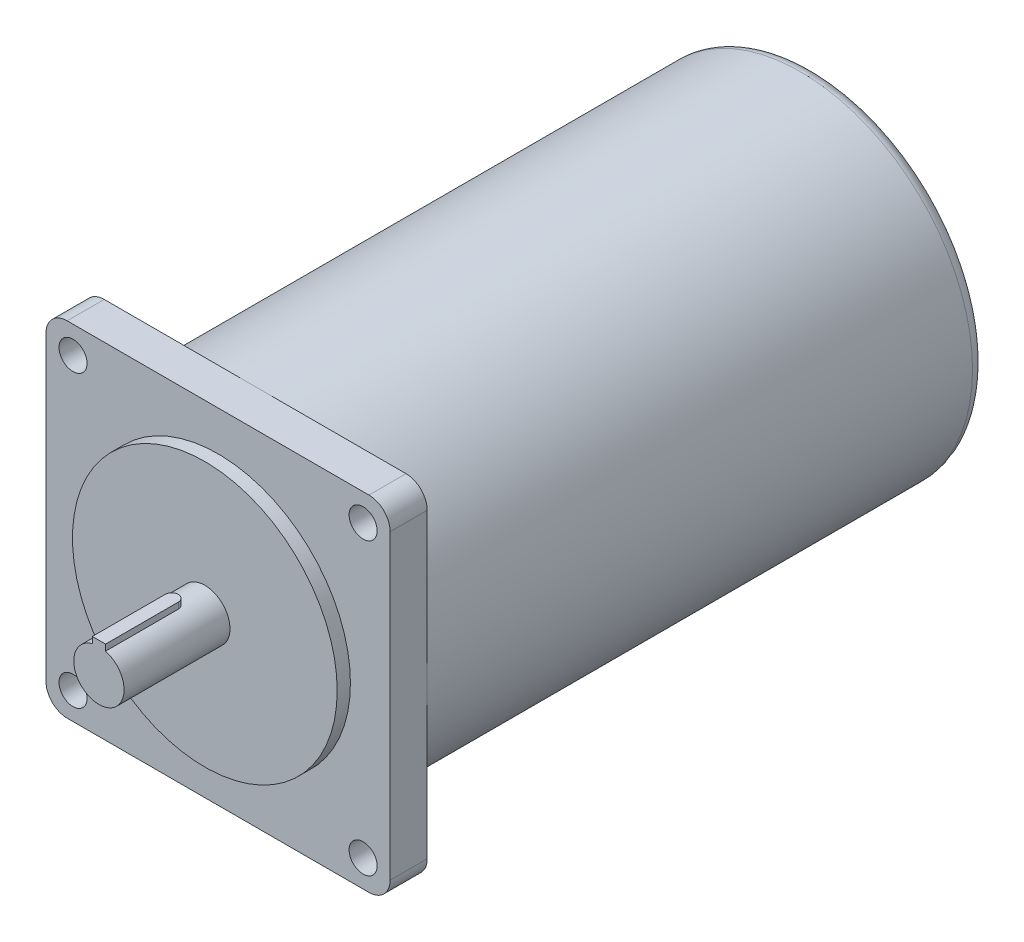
ISO-10303-21;
HEADER;
FILE_DESCRIPTION(('STEP AP214'),'2;1');
FILE_NAME('part.step','',(''),(''),'','','');
FILE_SCHEMA(('AUTOMOTIVE_DESIGN { 1 0 10303 214 1 1 1 1 }'));
ENDSEC;
DATA;
#1=APPLICATION_CONTEXT('core data for automotive mechanical design processes');
#2=APPLICATION_PROTOCOL_DEFINITION('international standard','automotive_design',2000,#1);
#3=PRODUCT_CONTEXT('',#1,'mechanical');
#4=PRODUCT('Part','Part','',(#3));
#5=PRODUCT_RELATED_PRODUCT_CATEGORY('part','',(#4));
#6=PRODUCT_DEFINITION_FORMATION('','',#4);
#7=PRODUCT_DEFINITION_CONTEXT('part definition',#1,'design');
#8=PRODUCT_DEFINITION('design','',#6,#7);
#9=PRODUCT_DEFINITION_SHAPE('','',#8);
#10=(LENGTH_UNIT() NAMED_UNIT(*) SI_UNIT(.MILLI.,.METRE.));
#11=(NAMED_UNIT(*) PLANE_ANGLE_UNIT() SI_UNIT($,.RADIAN.));
#12=(NAMED_UNIT(*) SI_UNIT($,.STERADIAN.) SOLID_ANGLE_UNIT());
#13=UNCERTAINTY_MEASURE_WITH_UNIT(LENGTH_MEASURE(1.E-05),#10,'distance_accuracy_value','');
#14=(GEOMETRIC_REPRESENTATION_CONTEXT(3) GLOBAL_UNCERTAINTY_ASSIGNED_CONTEXT((#13)) GLOBAL_UNIT_ASSIGNED_CONTEXT((#10,
#11,#12)) REPRESENTATION_CONTEXT('',''));
#15=CARTESIAN_POINT('',(0.,0.,0.));
#16=DIRECTION('',(0.,0.,1.));
#17=DIRECTION('',(1.,0.,0.));
#18=AXIS2_PLACEMENT_3D('',#15,#16,#17);
#19=CARTESIAN_POINT('',(57.,-57.,-19.));
#20=DIRECTION('',(0.,0.,1.));
#21=DIRECTION('',(1.,0.,0.));
#22=AXIS2_PLACEMENT_3D('',#19,#20,#21);
#23=PLANE('',#22);
#24=CARTESIAN_POINT('',(-54.8,54.8,-19.));
#25=DIRECTION('',(0.,0.,-1.));
#26=DIRECTION('',(-1.,0.,0.));
#27=AXIS2_PLACEMENT_3D('',#24,#25,#26);
#28=CIRCLE('',#27,5.3);
#29=CARTESIAN_POINT('',(-60.1,54.8,-19.));
#30=VERTEX_POINT('',#29);
#31=EDGE_CURVE('E184',#30,#30,#28,.T.);
#32=ORIENTED_EDGE('',*,*,#31,.F.);
#33=EDGE_LOOP('',(#32));
#34=FACE_BOUND('',#33,.T.);
#35=CARTESIAN_POINT('',(0.,0.,-19.));
#36=DIRECTION('',(0.,0.,-1.));
#37=DIRECTION('',(-1.,0.,0.));
#38=AXIS2_PLACEMENT_3D('',#35,#36,#37);
#39=CIRCLE('',#38,65.);
#40=CARTESIAN_POINT('',(-65.,0.,-19.));
#41=VERTEX_POINT('',#40);
#42=CARTESIAN_POINT('',(0.,65.,-19.));
#43=VERTEX_POINT('',#42);
#44=EDGE_CURVE('E160',#41,#43,#39,.T.);
#45=ORIENTED_EDGE('',*,*,#44,.F.);
#46=DIRECTION('',(0.,1.,0.));
#47=VECTOR('',#46,1.);
#48=CARTESIAN_POINT('',(-65.,56.9999999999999,-19.));
#49=LINE('',#48,#47);
#50=CARTESIAN_POINT('',(-65.,56.9999999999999,-19.));
#51=VERTEX_POINT('',#50);
#52=EDGE_CURVE('E149',#41,#51,#49,.T.);
#53=ORIENTED_EDGE('',*,*,#52,.T.);
#54=CARTESIAN_POINT('',(-57.,57.,-19.));
#55=DIRECTION('',(0.,0.,-1.));
#56=DIRECTION('',(1.,0.,0.));
#57=AXIS2_PLACEMENT_3D('',#54,#55,#56);
#58=CIRCLE('',#57,8.);
#59=CARTESIAN_POINT('',(-56.9999999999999,65.,-19.));
#60=VERTEX_POINT('',#59);
#61=EDGE_CURVE('E148',#51,#60,#58,.T.);
#62=ORIENTED_EDGE('',*,*,#61,.T.);
#63=DIRECTION('',(1.,0.,0.));
#64=VECTOR('',#63,1.);
#65=CARTESIAN_POINT('',(0.,65.,-19.));
#66=LINE('',#65,#64);
#67=EDGE_CURVE('E162',#60,#43,#66,.T.);
#68=ORIENTED_EDGE('',*,*,#67,.T.);
#69=EDGE_LOOP('',(#45,#53,#62,#68));
#70=FACE_BOUND('',#69,.T.);
#71=ADVANCED_FACE('F35',(#34,#70),#23,.F.);
#72=CARTESIAN_POINT('',(54.8,54.8,-19.));
#73=DIRECTION('',(0.,0.,-1.));
#74=DIRECTION('',(-1.,0.,0.));
#75=AXIS2_PLACEMENT_3D('',#72,#73,#74);
#76=CIRCLE('',#75,5.3);
#77=CARTESIAN_POINT('',(49.5,54.8,-19.));
#78=VERTEX_POINT('',#77);
#79=EDGE_CURVE('E190',#78,#78,#76,.T.);
#80=ORIENTED_EDGE('',*,*,#79,.F.);
#81=EDGE_LOOP('',(#80));
#82=FACE_BOUND('',#81,.T.);
#83=CARTESIAN_POINT('',(65.,0.,-19.));
#84=VERTEX_POINT('',#83);
#85=EDGE_CURVE('E58',#43,#84,#39,.T.);
#86=ORIENTED_EDGE('',*,*,#85,.F.);
#87=CARTESIAN_POINT('',(56.9999999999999,65.,-19.));
#88=VERTEX_POINT('',#87);
#89=EDGE_CURVE('E205',#43,#88,#66,.T.);
#90=ORIENTED_EDGE('',*,*,#89,.T.);
#91=CARTESIAN_POINT('',(57.,57.,-19.));
#92=DIRECTION('',(0.,0.,-1.));
#93=DIRECTION('',(1.,0.,0.));
#94=AXIS2_PLACEMENT_3D('',#91,#92,#93);
#95=CIRCLE('',#94,8.);
#96=CARTESIAN_POINT('',(65.,56.9999999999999,-19.));
#97=VERTEX_POINT('',#96);
#98=EDGE_CURVE('E207',#88,#97,#95,.T.);
#99=ORIENTED_EDGE('',*,*,#98,.T.);
#100=DIRECTION('',(0.,-1.,0.));
#101=VECTOR('',#100,1.);
#102=CARTESIAN_POINT('',(65.,-57.,-19.));
#103=LINE('',#102,#101);
#104=EDGE_CURVE('E210',#97,#84,#103,.T.);
#105=ORIENTED_EDGE('',*,*,#104,.T.);
#106=EDGE_LOOP('',(#86,#90,#99,#105));
#107=FACE_BOUND('',#106,.T.);
#108=ADVANCED_FACE('F311',(#82,#107),#23,.F.);
#109=CARTESIAN_POINT('',(54.8,-54.8,-19.));
#110=DIRECTION('',(0.,0.,-1.));
#111=DIRECTION('',(-1.,0.,0.));
#112=AXIS2_PLACEMENT_3D('',#109,#110,#111);
#113=CIRCLE('',#112,5.3);
#114=CARTESIAN_POINT('',(49.5,-54.8,-19.));
#115=VERTEX_POINT('',#114);
#116=EDGE_CURVE('E172',#115,#115,#113,.T.);
#117=ORIENTED_EDGE('',*,*,#116,.F.);
#118=EDGE_LOOP('',(#117));
#119=FACE_BOUND('',#118,.T.);
#120=CARTESIAN_POINT('',(0.,-65.,-19.));
#121=VERTEX_POINT('',#120);
#122=EDGE_CURVE('E50',#84,#121,#39,.T.);
#123=ORIENTED_EDGE('',*,*,#122,.F.);
#124=CARTESIAN_POINT('',(65.,-57.,-19.));
#125=VERTEX_POINT('',#124);
#126=EDGE_CURVE('E209',#84,#125,#103,.T.);
#127=ORIENTED_EDGE('',*,*,#126,.T.);
#128=CARTESIAN_POINT('',(57.,-57.,-19.));
#129=DIRECTION('',(0.,0.,-1.));
#130=DIRECTION('',(1.,0.,0.));
#131=AXIS2_PLACEMENT_3D('',#128,#129,#130);
#132=CIRCLE('',#131,8.);
#133=CARTESIAN_POINT('',(56.9999999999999,-65.,-19.));
#134=VERTEX_POINT('',#133);
#135=EDGE_CURVE('E196',#125,#134,#132,.T.);
#136=ORIENTED_EDGE('',*,*,#135,.T.);
#137=DIRECTION('',(-1.,0.,0.));
#138=VECTOR('',#137,1.);
#139=CARTESIAN_POINT('',(-57.,-65.,-19.));
#140=LINE('',#139,#138);
#141=EDGE_CURVE('E201',#134,#121,#140,.T.);
#142=ORIENTED_EDGE('',*,*,#141,.T.);
#143=EDGE_LOOP('',(#123,#127,#136,#142));
#144=FACE_BOUND('',#143,.T.);
#145=ADVANCED_FACE('F317',(#119,#144),#23,.F.);
#146=CARTESIAN_POINT('',(-54.8,-54.8,-19.));
#147=DIRECTION('',(0.,0.,-1.));
#148=DIRECTION('',(-1.,0.,0.));
#149=AXIS2_PLACEMENT_3D('',#146,#147,#148);
#150=CIRCLE('',#149,5.3);
#151=CARTESIAN_POINT('',(-60.1,-54.8,-19.));
#152=VERTEX_POINT('',#151);
#153=EDGE_CURVE('E178',#152,#152,#150,.T.);
#154=ORIENTED_EDGE('',*,*,#153,.F.);
#155=EDGE_LOOP('',(#154));
#156=FACE_BOUND('',#155,.T.);
#157=EDGE_CURVE('E141',#121,#41,#39,.T.);
#158=ORIENTED_EDGE('',*,*,#157,.F.);
#159=CARTESIAN_POINT('',(-57.,-65.,-19.));
#160=VERTEX_POINT('',#159);
#161=EDGE_CURVE('E199',#121,#160,#140,.T.);
#162=ORIENTED_EDGE('',*,*,#161,.T.);
#163=CARTESIAN_POINT('',(-57.,-57.,-19.));
#164=DIRECTION('',(0.,0.,-1.));
#165=DIRECTION('',(1.,0.,0.));
#166=AXIS2_PLACEMENT_3D('',#163,#164,#165);
#167=CIRCLE('',#166,8.);
#168=CARTESIAN_POINT('',(-65.,-56.9999999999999,-19.));
#169=VERTEX_POINT('',#168);
#170=EDGE_CURVE('E144',#160,#169,#167,.T.);
#171=ORIENTED_EDGE('',*,*,#170,.T.);
#172=EDGE_CURVE('E137',#169,#41,#49,.T.);
#173=ORIENTED_EDGE('',*,*,#172,.T.);
#174=EDGE_LOOP('',(#158,#162,#171,#173));
#175=FACE_BOUND('',#174,.T.);
#176=ADVANCED_FACE('F139',(#156,#175),#23,.F.);
#177=CARTESIAN_POINT('',(0.,0.,40.));
#178=DIRECTION('',(0.,0.,-1.));
#179=DIRECTION('',(-1.,0.,0.));
#180=AXIS2_PLACEMENT_3D('',#177,#178,#179);
#181=CYLINDRICAL_SURFACE('',#180,9.5);
#182=CARTESIAN_POINT('',(0.,0.,0.));
#183=DIRECTION('',(0.,0.,1.));
#184=DIRECTION('',(1.,0.,0.));
#185=AXIS2_PLACEMENT_3D('',#182,#183,#184);
#186=CIRCLE('',#185,9.5);
#187=CARTESIAN_POINT('',(9.5,0.,0.));
#188=VERTEX_POINT('',#187);
#189=EDGE_CURVE('E279',#188,#188,#186,.T.);
#190=ORIENTED_EDGE('',*,*,#189,.T.);
#191=EDGE_LOOP('',(#190));
#192=FACE_BOUND('',#191,.T.);
#193=DIRECTION('',(0.,0.,-1.));
#194=VECTOR('',#193,1.);
#195=CARTESIAN_POINT('',(-2.5,9.16515138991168,40.));
#196=LINE('',#195,#194);
#197=CARTESIAN_POINT('',(-2.5,9.16515138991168,12.5));
#198=VERTEX_POINT('',#197);
#199=CARTESIAN_POINT('',(-2.5,9.16515138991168,40.));
#200=VERTEX_POINT('',#199);
#201=EDGE_CURVE('E276',#198,#200,#196,.F.);
#202=ORIENTED_EDGE('',*,*,#201,.F.);
#203=CARTESIAN_POINT('',(0.,9.5,10.));
#204=CARTESIAN_POINT('',(-0.137884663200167,9.4999978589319,10.0000034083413));
#205=CARTESIAN_POINT('',(-0.275806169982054,9.49696845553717,10.0114455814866));
#206=CARTESIAN_POINT('',(-0.547680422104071,9.48517762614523,10.0568336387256));
#207=CARTESIAN_POINT('',(-0.681631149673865,9.47641333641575,10.0907907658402));
#208=CARTESIAN_POINT('',(-0.941599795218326,9.45412076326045,10.1800315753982));
#209=CARTESIAN_POINT('',(-1.06762755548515,9.44059853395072,10.2352881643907));
#210=CARTESIAN_POINT('',(-1.30862652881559,9.41022151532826,10.3654600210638));
#211=CARTESIAN_POINT('',(-1.42359708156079,9.39336652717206,10.4403764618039));
#212=CARTESIAN_POINT('',(-1.64181993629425,9.35771941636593,10.6095316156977));
#213=CARTESIAN_POINT('',(-1.74478634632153,9.33889486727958,10.7041323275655));
#214=CARTESIAN_POINT('',(-1.93359084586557,9.30164002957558,10.9091965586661));
#215=CARTESIAN_POINT('',(-2.01942679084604,9.28320979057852,11.0196620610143));
#216=CARTESIAN_POINT('',(-2.17291708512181,9.24849966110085,11.2555887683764));
#217=CARTESIAN_POINT('',(-2.24024449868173,9.23226073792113,11.3812692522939));
#218=CARTESIAN_POINT('',(-2.35270147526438,9.20424780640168,11.6426621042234));
#219=CARTESIAN_POINT('',(-2.39783501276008,9.19247299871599,11.7783726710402));
#220=CARTESIAN_POINT('',(-2.46363395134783,9.17505594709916,12.0528119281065));
#221=CARTESIAN_POINT('',(-2.48481677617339,9.16928424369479,12.1914081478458));
#222=CARTESIAN_POINT('',(-2.50372582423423,9.16413995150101,12.470298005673));
#223=CARTESIAN_POINT('',(-2.50145630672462,9.16476620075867,12.6105913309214));
#224=CARTESIAN_POINT('',(-2.47393631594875,9.1722310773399,12.8848702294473));
#225=CARTESIAN_POINT('',(-2.44930986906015,9.1789010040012,13.0189237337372));
#226=CARTESIAN_POINT('',(-2.37877367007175,9.19743185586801,13.2809260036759));
#227=CARTESIAN_POINT('',(-2.33286225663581,9.2092931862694,13.4088742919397));
#228=CARTESIAN_POINT('',(-2.22054589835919,9.23702010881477,13.6566707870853));
#229=CARTESIAN_POINT('',(-2.1539205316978,9.25292841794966,13.7764141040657));
#230=CARTESIAN_POINT('',(-2.00222137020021,9.28693362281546,14.0032413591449));
#231=CARTESIAN_POINT('',(-1.91714402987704,9.30503093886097,14.1103228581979));
#232=CARTESIAN_POINT('',(-1.72775627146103,9.3420790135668,14.3123544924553));
#233=CARTESIAN_POINT('',(-1.62292126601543,9.36103863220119,14.4068119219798));
#234=CARTESIAN_POINT('',(-1.3986680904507,9.39715951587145,14.5769046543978));
#235=CARTESIAN_POINT('',(-1.27924937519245,9.41432071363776,14.6525392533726));
#236=CARTESIAN_POINT('',(-1.02846858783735,9.44501219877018,14.7830484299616));
#237=CARTESIAN_POINT('',(-0.897059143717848,9.45852716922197,14.8378358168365));
#238=CARTESIAN_POINT('',(-0.626458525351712,9.48029259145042,14.924400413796));
#239=CARTESIAN_POINT('',(-0.487269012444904,9.48854416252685,14.9561825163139));
#240=CARTESIAN_POINT('',(-0.209265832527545,9.49868456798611,14.9950653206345));
#241=CARTESIAN_POINT('',(-0.070552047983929,9.50074610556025,15.0028361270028));
#242=CARTESIAN_POINT('',(0.206196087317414,9.49876969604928,14.9953236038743));
#243=CARTESIAN_POINT('',(0.344230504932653,9.49473236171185,14.9800425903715));
#244=CARTESIAN_POINT('',(0.613323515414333,9.48112321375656,14.9274104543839));
#245=CARTESIAN_POINT('',(0.744460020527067,9.47164474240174,14.8904313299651));
#246=CARTESIAN_POINT('',(0.998656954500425,9.44822690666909,14.7958831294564));
#247=CARTESIAN_POINT('',(1.12171651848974,9.43428706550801,14.7383118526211));
#248=CARTESIAN_POINT('',(1.35888360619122,9.40308612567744,14.6029586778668));
#249=CARTESIAN_POINT('',(1.47277384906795,9.38576639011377,14.5248099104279));
#250=CARTESIAN_POINT('',(1.68605972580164,9.34980860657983,14.3509829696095));
#251=CARTESIAN_POINT('',(1.78545256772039,9.33117030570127,14.2553014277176));
#252=CARTESIAN_POINT('',(1.96973268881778,9.29404354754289,14.0460009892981));
#253=CARTESIAN_POINT('',(2.05414772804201,9.27557319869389,13.9319623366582));
#254=CARTESIAN_POINT('',(2.20265077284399,9.24143699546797,13.690949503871));
#255=CARTESIAN_POINT('',(2.26673964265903,9.22577102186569,13.5639758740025));
#256=CARTESIAN_POINT('',(2.37228864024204,9.1991961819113,13.3013437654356));
#257=CARTESIAN_POINT('',(2.41388084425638,9.18825962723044,13.165741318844));
#258=CARTESIAN_POINT('',(2.47357685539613,9.17237100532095,12.8891317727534));
#259=CARTESIAN_POINT('',(2.49168647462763,9.16741745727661,12.7481260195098));
#260=CARTESIAN_POINT('',(2.5035754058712,9.16417710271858,12.4695408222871));
#261=CARTESIAN_POINT('',(2.49811278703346,9.16568256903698,12.3319956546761));
#262=CARTESIAN_POINT('',(2.46476570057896,9.17470557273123,12.0598619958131));
#263=CARTESIAN_POINT('',(2.43688178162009,9.18222296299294,11.9252734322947));
#264=CARTESIAN_POINT('',(2.35991776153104,9.20230081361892,11.6637995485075));
#265=CARTESIAN_POINT('',(2.31099432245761,9.21482395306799,11.5368650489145));
#266=CARTESIAN_POINT('',(2.19346205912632,9.2435040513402,11.2929108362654));
#267=CARTESIAN_POINT('',(2.12485022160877,9.25966156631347,11.1758926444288));
#268=CARTESIAN_POINT('',(1.96757430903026,9.29436941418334,10.9514645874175));
#269=CARTESIAN_POINT('',(1.87839103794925,9.31297513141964,10.8444270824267));
#270=CARTESIAN_POINT('',(1.68349652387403,9.35016921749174,10.6465905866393));
#271=CARTESIAN_POINT('',(1.57778128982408,9.36875758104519,10.5557955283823));
#272=CARTESIAN_POINT('',(1.35018708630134,9.40428175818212,10.3911797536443));
#273=CARTESIAN_POINT('',(1.22801920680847,9.42117547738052,10.3177486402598));
#274=CARTESIAN_POINT('',(0.972633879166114,9.45095016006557,10.1925825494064));
#275=CARTESIAN_POINT('',(0.839423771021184,9.46383376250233,10.1408332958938));
#276=CARTESIAN_POINT('',(0.588875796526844,9.48241870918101,10.0674519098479));
#277=CARTESIAN_POINT('',(0.472643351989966,9.4889642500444,10.0422152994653));
#278=CARTESIAN_POINT('',(0.237616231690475,9.49775561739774,10.0084886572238));
#279=CARTESIAN_POINT('',(0.118821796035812,9.50000184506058,9.99999706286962));
#280=CARTESIAN_POINT('',(0.,9.5,10.));
#281=B_SPLINE_CURVE_WITH_KNOTS('',3,(#203,#204,#205,#206,#207,#208,#209,#210,#211,#212,#213,
#214,#215,#216,#217,#218,#219,#220,#221,#222,#223,#224,#225,#226,#227,#228,#229,#230,#231,#232,
#233,#234,#235,#236,#237,#238,#239,#240,#241,#242,#243,#244,#245,#246,#247,#248,#249,#250,#251,
#252,#253,#254,#255,#256,#257,#258,#259,#260,#261,#262,#263,#264,#265,#266,#267,#268,#269,#270,
#271,#272,#273,#274,#275,#276,#277,#278,#279,#280),.UNSPECIFIED.,.T.,.F.,(4,2,2,2,2,2,2,2,2,2,2,
2,2,2,2,2,2,2,2,2,2,2,2,2,2,2,2,2,2,2,2,2,2,2,2,2,2,2,4),(0.,0.41321830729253,0.826643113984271,
1.23954376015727,1.65246904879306,2.07379267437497,2.49516901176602,2.92356960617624,
3.35189345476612,3.77077570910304,4.18958189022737,4.59704611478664,5.00454214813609,
5.41653210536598,5.82860129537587,6.25374475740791,6.67890411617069,7.10582259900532,
7.53265026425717,7.9474532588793,8.36221458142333,8.77006471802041,9.17795845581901,
9.59368485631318,10.0094912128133,10.4366941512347,10.8638789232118,11.2885277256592,
11.7130714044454,12.1240655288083,12.5350495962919,12.9430250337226,13.3510629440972,
13.7708169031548,14.1906723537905,14.6192052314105,15.0474555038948,15.4035786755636,
15.7596686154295),.UNSPECIFIED.);
#282=CARTESIAN_POINT('',(2.5,9.16515138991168,12.5));
#283=VERTEX_POINT('',#282);
#284=EDGE_CURVE('E167',#283,#198,#281,.T.);
#285=ORIENTED_EDGE('',*,*,#284,.F.);
#286=DIRECTION('',(0.,0.,-1.));
#287=VECTOR('',#286,1.);
#288=CARTESIAN_POINT('',(2.5,9.16515138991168,40.));
#289=LINE('',#288,#287);
#290=CARTESIAN_POINT('',(2.5,9.16515138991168,40.));
#291=VERTEX_POINT('',#290);
#292=EDGE_CURVE('E273',#291,#283,#289,.T.);
#293=ORIENTED_EDGE('',*,*,#292,.F.);
#294=CARTESIAN_POINT('',(0.,0.,40.));
#295=DIRECTION('',(0.,0.,1.));
#296=DIRECTION('',(1.,0.,0.));
#297=AXIS2_PLACEMENT_3D('',#294,#295,#296);
#298=CIRCLE('',#297,9.5);
#299=EDGE_CURVE('E280',#200,#291,#298,.T.);
#300=ORIENTED_EDGE('',*,*,#299,.F.);
#301=EDGE_LOOP('',(#202,#285,#293,#300));
#302=FACE_BOUND('',#301,.T.);
#303=ADVANCED_FACE('F290',(#192,#302),#181,.T.);
#304=CARTESIAN_POINT('',(0.,0.,0.));
#305=DIRECTION('',(0.,0.,1.));
#306=DIRECTION('',(1.,0.,0.));
#307=AXIS2_PLACEMENT_3D('',#304,#305,#306);
#308=PLANE('',#307);
#309=CARTESIAN_POINT('',(0.,0.,0.));
#310=DIRECTION('',(0.,0.,1.));
#311=DIRECTION('',(1.,0.,0.));
#312=AXIS2_PLACEMENT_3D('',#309,#310,#311);
#313=CIRCLE('',#312,50.);
#314=CARTESIAN_POINT('',(50.,0.,0.));
#315=VERTEX_POINT('',#314);
#316=EDGE_CURVE('E169',#315,#315,#313,.T.);
#317=ORIENTED_EDGE('',*,*,#316,.T.);
#318=EDGE_LOOP('',(#317));
#319=FACE_BOUND('',#318,.T.);
#320=ORIENTED_EDGE('',*,*,#189,.F.);
#321=EDGE_LOOP('',(#320));
#322=FACE_BOUND('',#321,.T.);
#323=ADVANCED_FACE('F308',(#319,#322),#308,.T.);
#324=CARTESIAN_POINT('',(0.,0.,-5.));
#325=DIRECTION('',(0.,0.,1.));
#326=DIRECTION('',(1.,0.,0.));
#327=AXIS2_PLACEMENT_3D('',#324,#325,#326);
#328=CYLINDRICAL_SURFACE('',#327,50.);
#329=CARTESIAN_POINT('',(0.,0.,-5.));
#330=DIRECTION('',(0.,0.,1.));
#331=DIRECTION('',(1.,0.,0.));
#332=AXIS2_PLACEMENT_3D('',#329,#330,#331);
#333=CIRCLE('',#332,50.);
#334=CARTESIAN_POINT('',(50.,0.,-5.));
#335=VERTEX_POINT('',#334);
#336=EDGE_CURVE('E249',#335,#335,#333,.F.);
#337=ORIENTED_EDGE('',*,*,#336,.F.);
#338=EDGE_LOOP('',(#337));
#339=FACE_BOUND('',#338,.T.);
#340=ORIENTED_EDGE('',*,*,#316,.F.);
#341=EDGE_LOOP('',(#340));
#342=FACE_BOUND('',#341,.T.);
#343=ADVANCED_FACE('F303',(#339,#342),#328,.T.);
#344=CARTESIAN_POINT('',(0.,0.,40.));
#345=DIRECTION('',(0.,0.,1.));
#346=DIRECTION('',(1.,0.,0.));
#347=AXIS2_PLACEMENT_3D('',#344,#345,#346);
#348=PLANE('',#347);
#349=ORIENTED_EDGE('',*,*,#299,.T.);
#350=DIRECTION('',(0.,-1.,0.));
#351=VECTOR('',#350,1.);
#352=CARTESIAN_POINT('',(2.5,11.5,40.));
#353=LINE('',#352,#351);
#354=CARTESIAN_POINT('',(2.5,11.5,40.));
#355=VERTEX_POINT('',#354);
#356=EDGE_CURVE('E264',#355,#291,#353,.T.);
#357=ORIENTED_EDGE('',*,*,#356,.F.);
#358=DIRECTION('',(1.,0.,0.));
#359=VECTOR('',#358,1.);
#360=CARTESIAN_POINT('',(-2.5,11.5,40.));
#361=LINE('',#360,#359);
#362=CARTESIAN_POINT('',(-2.5,11.5,40.));
#363=VERTEX_POINT('',#362);
#364=EDGE_CURVE('E257',#363,#355,#361,.T.);
#365=ORIENTED_EDGE('',*,*,#364,.F.);
#366=DIRECTION('',(0.,-1.,0.));
#367=VECTOR('',#366,1.);
#368=CARTESIAN_POINT('',(-2.5,11.5,40.));
#369=LINE('',#368,#367);
#370=EDGE_CURVE('E267',#363,#200,#369,.T.);
#371=ORIENTED_EDGE('',*,*,#370,.T.);
#372=EDGE_LOOP('',(#349,#357,#365,#371));
#373=FACE_BOUND('',#372,.T.);
#374=ADVANCED_FACE('F299',(#373),#348,.T.);
#375=CARTESIAN_POINT('',(0.,11.5,12.5));
#376=DIRECTION('',(0.,-1.,0.));
#377=DIRECTION('',(0.,0.,-1.));
#378=AXIS2_PLACEMENT_3D('',#375,#376,#377);
#379=CYLINDRICAL_SURFACE('',#378,2.5);
#380=DIRECTION('',(0.,-1.,0.));
#381=VECTOR('',#380,1.);
#382=CARTESIAN_POINT('',(2.5,11.5,12.5));
#383=LINE('',#382,#381);
#384=CARTESIAN_POINT('',(2.5,11.5,12.5));
#385=VERTEX_POINT('',#384);
#386=EDGE_CURVE('E261',#385,#283,#383,.T.);
#387=ORIENTED_EDGE('',*,*,#386,.T.);
#388=ORIENTED_EDGE('',*,*,#284,.T.);
#389=DIRECTION('',(0.,-1.,0.));
#390=VECTOR('',#389,1.);
#391=CARTESIAN_POINT('',(-2.5,11.5,12.5));
#392=LINE('',#391,#390);
#393=CARTESIAN_POINT('',(-2.5,11.5,12.5));
#394=VERTEX_POINT('',#393);
#395=EDGE_CURVE('E270',#394,#198,#392,.T.);
#396=ORIENTED_EDGE('',*,*,#395,.F.);
#397=CARTESIAN_POINT('',(0.,11.5,12.5));
#398=DIRECTION('',(0.,1.,0.));
#399=DIRECTION('',(0.,0.,1.));
#400=AXIS2_PLACEMENT_3D('',#397,#398,#399);
#401=CIRCLE('',#400,2.5);
#402=EDGE_CURVE('E252',#385,#394,#401,.T.);
#403=ORIENTED_EDGE('',*,*,#402,.F.);
#404=EDGE_LOOP('',(#387,#388,#396,#403));
#405=FACE_BOUND('',#404,.T.);
#406=ADVANCED_FACE('F294',(#405),#379,.T.);
#407=CARTESIAN_POINT('',(-2.5,11.5,12.5));
#408=DIRECTION('',(1.,0.,0.));
#409=DIRECTION('',(0.,0.,-1.));
#410=AXIS2_PLACEMENT_3D('',#407,#408,#409);
#411=PLANE('',#410);
#412=ORIENTED_EDGE('',*,*,#395,.T.);
#413=ORIENTED_EDGE('',*,*,#201,.T.);
#414=ORIENTED_EDGE('',*,*,#370,.F.);
#415=DIRECTION('',(0.,0.,1.));
#416=VECTOR('',#415,1.);
#417=CARTESIAN_POINT('',(-2.5,11.5,12.5));
#418=LINE('',#417,#416);
#419=EDGE_CURVE('E255',#394,#363,#418,.T.);
#420=ORIENTED_EDGE('',*,*,#419,.F.);
#421=EDGE_LOOP('',(#412,#413,#414,#420));
#422=FACE_BOUND('',#421,.T.);
#423=ADVANCED_FACE('F298',(#422),#411,.F.);
#424=CARTESIAN_POINT('',(2.5,11.5,40.));
#425=DIRECTION('',(-1.,0.,0.));
#426=DIRECTION('',(0.,0.,1.));
#427=AXIS2_PLACEMENT_3D('',#424,#425,#426);
#428=PLANE('',#427);
#429=ORIENTED_EDGE('',*,*,#356,.T.);
#430=ORIENTED_EDGE('',*,*,#292,.T.);
#431=ORIENTED_EDGE('',*,*,#386,.F.);
#432=DIRECTION('',(0.,0.,-1.));
#433=VECTOR('',#432,1.);
#434=CARTESIAN_POINT('',(2.5,11.5,40.));
#435=LINE('',#434,#433);
#436=EDGE_CURVE('E259',#355,#385,#435,.T.);
#437=ORIENTED_EDGE('',*,*,#436,.F.);
#438=EDGE_LOOP('',(#429,#430,#431,#437));
#439=FACE_BOUND('',#438,.T.);
#440=ADVANCED_FACE('F408',(#439),#428,.F.);
#441=CARTESIAN_POINT('',(0.,11.5,12.5));
#442=DIRECTION('',(0.,1.,0.));
#443=DIRECTION('',(0.,0.,1.));
#444=AXIS2_PLACEMENT_3D('',#441,#442,#443);
#445=PLANE('',#444);
#446=ORIENTED_EDGE('',*,*,#402,.T.);
#447=ORIENTED_EDGE('',*,*,#419,.T.);
#448=ORIENTED_EDGE('',*,*,#364,.T.);
#449=ORIENTED_EDGE('',*,*,#436,.T.);
#450=EDGE_LOOP('',(#446,#447,#448,#449));
#451=FACE_BOUND('',#450,.T.);
#452=ADVANCED_FACE('F344',(#451),#445,.T.);
#453=CARTESIAN_POINT('',(57.,-57.,-5.));
#454=DIRECTION('',(0.,0.,1.));
#455=DIRECTION('',(1.,0.,0.));
#456=AXIS2_PLACEMENT_3D('',#453,#454,#455);
#457=PLANE('',#456);
#458=ORIENTED_EDGE('',*,*,#336,.T.);
#459=EDGE_LOOP('',(#458));
#460=FACE_BOUND('',#459,.T.);
#461=CARTESIAN_POINT('',(-54.8,-54.8,-5.));
#462=DIRECTION('',(0.,0.,-1.));
#463=DIRECTION('',(-1.,0.,0.));
#464=AXIS2_PLACEMENT_3D('',#461,#462,#463);
#465=CIRCLE('',#464,5.3);
#466=CARTESIAN_POINT('',(-60.1,-54.8,-5.));
#467=VERTEX_POINT('',#466);
#468=EDGE_CURVE('E175',#467,#467,#465,.T.);
#469=ORIENTED_EDGE('',*,*,#468,.T.);
#470=EDGE_LOOP('',(#469));
#471=FACE_BOUND('',#470,.T.);
#472=CARTESIAN_POINT('',(54.8,54.8,-5.));
#473=DIRECTION('',(0.,0.,-1.));
#474=DIRECTION('',(-1.,0.,0.));
#475=AXIS2_PLACEMENT_3D('',#472,#473,#474);
#476=CIRCLE('',#475,5.3);
#477=CARTESIAN_POINT('',(49.5,54.8,-5.));
#478=VERTEX_POINT('',#477);
#479=EDGE_CURVE('E187',#478,#478,#476,.T.);
#480=ORIENTED_EDGE('',*,*,#479,.T.);
#481=EDGE_LOOP('',(#480));
#482=FACE_BOUND('',#481,.T.);
#483=CARTESIAN_POINT('',(57.,-57.,-5.));
#484=DIRECTION('',(0.,0.,-1.));
#485=DIRECTION('',(1.,0.,0.));
#486=AXIS2_PLACEMENT_3D('',#483,#484,#485);
#487=CIRCLE('',#486,8.);
#488=CARTESIAN_POINT('',(65.,-57.,-5.));
#489=VERTEX_POINT('',#488);
#490=CARTESIAN_POINT('',(56.9999999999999,-65.,-5.));
#491=VERTEX_POINT('',#490);
#492=EDGE_CURVE('E193',#489,#491,#487,.T.);
#493=ORIENTED_EDGE('',*,*,#492,.F.);
#494=DIRECTION('',(0.,-1.,0.));
#495=VECTOR('',#494,1.);
#496=CARTESIAN_POINT('',(65.,-57.,-5.));
#497=LINE('',#496,#495);
#498=CARTESIAN_POINT('',(65.,56.9999999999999,-5.));
#499=VERTEX_POINT('',#498);
#500=EDGE_CURVE('E200',#499,#489,#497,.T.);
#501=ORIENTED_EDGE('',*,*,#500,.F.);
#502=CARTESIAN_POINT('',(57.,57.,-5.));
#503=DIRECTION('',(0.,0.,-1.));
#504=DIRECTION('',(1.,0.,0.));
#505=AXIS2_PLACEMENT_3D('',#502,#503,#504);
#506=CIRCLE('',#505,8.);
#507=CARTESIAN_POINT('',(56.9999999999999,65.,-5.));
#508=VERTEX_POINT('',#507);
#509=EDGE_CURVE('E226',#508,#499,#506,.T.);
#510=ORIENTED_EDGE('',*,*,#509,.F.);
#511=DIRECTION('',(1.,0.,0.));
#512=VECTOR('',#511,1.);
#513=CARTESIAN_POINT('',(56.9999999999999,65.,-5.));
#514=LINE('',#513,#512);
#515=CARTESIAN_POINT('',(-56.9999999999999,65.,-5.));
#516=VERTEX_POINT('',#515);
#517=EDGE_CURVE('E224',#516,#508,#514,.T.);
#518=ORIENTED_EDGE('',*,*,#517,.F.);
#519=CARTESIAN_POINT('',(-57.,57.,-5.));
#520=DIRECTION('',(0.,0.,-1.));
#521=DIRECTION('',(1.,0.,0.));
#522=AXIS2_PLACEMENT_3D('',#519,#520,#521);
#523=CIRCLE('',#522,8.);
#524=CARTESIAN_POINT('',(-65.,56.9999999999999,-5.));
#525=VERTEX_POINT('',#524);
#526=EDGE_CURVE('E221',#525,#516,#523,.T.);
#527=ORIENTED_EDGE('',*,*,#526,.F.);
#528=DIRECTION('',(0.,1.,0.));
#529=VECTOR('',#528,1.);
#530=CARTESIAN_POINT('',(-65.,56.9999999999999,-5.));
#531=LINE('',#530,#529);
#532=CARTESIAN_POINT('',(-65.,-56.9999999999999,-5.));
#533=VERTEX_POINT('',#532);
#534=EDGE_CURVE('E219',#533,#525,#531,.T.);
#535=ORIENTED_EDGE('',*,*,#534,.F.);
#536=CARTESIAN_POINT('',(-57.,-57.,-5.));
#537=DIRECTION('',(0.,0.,-1.));
#538=DIRECTION('',(1.,0.,0.));
#539=AXIS2_PLACEMENT_3D('',#536,#537,#538);
#540=CIRCLE('',#539,8.);
#541=CARTESIAN_POINT('',(-57.,-65.,-5.));
#542=VERTEX_POINT('',#541);
#543=EDGE_CURVE('E217',#542,#533,#540,.T.);
#544=ORIENTED_EDGE('',*,*,#543,.F.);
#545=DIRECTION('',(-1.,0.,0.));
#546=VECTOR('',#545,1.);
#547=CARTESIAN_POINT('',(-57.,-65.,-5.));
#548=LINE('',#547,#546);
#549=EDGE_CURVE('E215',#491,#542,#548,.T.);
#550=ORIENTED_EDGE('',*,*,#549,.F.);
#551=EDGE_LOOP('',(#493,#501,#510,#518,#527,#535,#544,#550));
#552=FACE_BOUND('',#551,.T.);
#553=CARTESIAN_POINT('',(-54.8,54.8,-5.));
#554=DIRECTION('',(0.,0.,-1.));
#555=DIRECTION('',(-1.,0.,0.));
#556=AXIS2_PLACEMENT_3D('',#553,#554,#555);
#557=CIRCLE('',#556,5.3);
#558=CARTESIAN_POINT('',(-60.1,54.8,-5.));
#559=VERTEX_POINT('',#558);
#560=EDGE_CURVE('E181',#559,#559,#557,.T.);
#561=ORIENTED_EDGE('',*,*,#560,.T.);
#562=EDGE_LOOP('',(#561));
#563=FACE_BOUND('',#562,.T.);
#564=CARTESIAN_POINT('',(54.8,-54.8,-5.));
#565=DIRECTION('',(0.,0.,-1.));
#566=DIRECTION('',(-1.,0.,0.));
#567=AXIS2_PLACEMENT_3D('',#564,#565,#566);
#568=CIRCLE('',#567,5.3);
#569=CARTESIAN_POINT('',(49.5,-54.8,-5.));
#570=VERTEX_POINT('',#569);
#571=EDGE_CURVE('E164',#570,#570,#568,.T.);
#572=ORIENTED_EDGE('',*,*,#571,.T.);
#573=EDGE_LOOP('',(#572));
#574=FACE_BOUND('',#573,.T.);
#575=ADVANCED_FACE('F340',(#460,#471,#482,#552,#563,#574),#457,.T.);
#576=CARTESIAN_POINT('',(57.,-57.,-19.));
#577=DIRECTION('',(0.,0.,1.));
#578=DIRECTION('',(1.,0.,0.));
#579=AXIS2_PLACEMENT_3D('',#576,#577,#578);
#580=CYLINDRICAL_SURFACE('',#579,8.);
#581=ORIENTED_EDGE('',*,*,#492,.T.);
#582=DIRECTION('',(0.,0.,1.));
#583=VECTOR('',#582,1.);
#584=CARTESIAN_POINT('',(56.9999999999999,-65.,-19.));
#585=LINE('',#584,#583);
#586=EDGE_CURVE('E246',#134,#491,#585,.T.);
#587=ORIENTED_EDGE('',*,*,#586,.F.);
#588=ORIENTED_EDGE('',*,*,#135,.F.);
#589=DIRECTION('',(0.,0.,1.));
#590=VECTOR('',#589,1.);
#591=CARTESIAN_POINT('',(65.,-57.,-19.));
#592=LINE('',#591,#590);
#593=EDGE_CURVE('E212',#125,#489,#592,.T.);
#594=ORIENTED_EDGE('',*,*,#593,.T.);
#595=EDGE_LOOP('',(#581,#587,#588,#594));
#596=FACE_BOUND('',#595,.T.);
#597=ADVANCED_FACE('F343',(#596),#580,.T.);
#598=CARTESIAN_POINT('',(-57.,-65.,-19.));
#599=DIRECTION('',(0.,1.,0.));
#600=DIRECTION('',(-1.,0.,0.));
#601=AXIS2_PLACEMENT_3D('',#598,#599,#600);
#602=PLANE('',#601);
#603=ORIENTED_EDGE('',*,*,#549,.T.);
#604=DIRECTION('',(0.,0.,1.));
#605=VECTOR('',#604,1.);
#606=CARTESIAN_POINT('',(-57.,-65.,-19.));
#607=LINE('',#606,#605);
#608=EDGE_CURVE('E243',#160,#542,#607,.T.);
#609=ORIENTED_EDGE('',*,*,#608,.F.);
#610=ORIENTED_EDGE('',*,*,#161,.F.);
#611=ORIENTED_EDGE('',*,*,#141,.F.);
#612=ORIENTED_EDGE('',*,*,#586,.T.);
#613=EDGE_LOOP('',(#603,#609,#610,#611,#612));
#614=FACE_BOUND('',#613,.T.);
#615=ADVANCED_FACE('F399',(#614),#602,.F.);
#616=CARTESIAN_POINT('',(-57.,-57.,-19.));
#617=DIRECTION('',(0.,0.,1.));
#618=DIRECTION('',(1.,0.,0.));
#619=AXIS2_PLACEMENT_3D('',#616,#617,#618);
#620=CYLINDRICAL_SURFACE('',#619,8.);
#621=ORIENTED_EDGE('',*,*,#543,.T.);
#622=DIRECTION('',(0.,0.,1.));
#623=VECTOR('',#622,1.);
#624=CARTESIAN_POINT('',(-65.,-56.9999999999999,-19.));
#625=LINE('',#624,#623);
#626=EDGE_CURVE('E241',#169,#533,#625,.T.);
#627=ORIENTED_EDGE('',*,*,#626,.F.);
#628=ORIENTED_EDGE('',*,*,#170,.F.);
#629=ORIENTED_EDGE('',*,*,#608,.T.);
#630=EDGE_LOOP('',(#621,#627,#628,#629));
#631=FACE_BOUND('',#630,.T.);
#632=ADVANCED_FACE('F396',(#631),#620,.T.);
#633=CARTESIAN_POINT('',(-65.,56.9999999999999,-19.));
#634=DIRECTION('',(1.,0.,0.));
#635=DIRECTION('',(0.,1.,0.));
#636=AXIS2_PLACEMENT_3D('',#633,#634,#635);
#637=PLANE('',#636);
#638=ORIENTED_EDGE('',*,*,#534,.T.);
#639=DIRECTION('',(0.,0.,1.));
#640=VECTOR('',#639,1.);
#641=CARTESIAN_POINT('',(-65.,56.9999999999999,-19.));
#642=LINE('',#641,#640);
#643=EDGE_CURVE('E155',#51,#525,#642,.T.);
#644=ORIENTED_EDGE('',*,*,#643,.F.);
#645=ORIENTED_EDGE('',*,*,#52,.F.);
#646=ORIENTED_EDGE('',*,*,#172,.F.);
#647=ORIENTED_EDGE('',*,*,#626,.T.);
#648=EDGE_LOOP('',(#638,#644,#645,#646,#647));
#649=FACE_BOUND('',#648,.T.);
#650=ADVANCED_FACE('F153',(#649),#637,.F.);
#651=CARTESIAN_POINT('',(-57.,57.,-19.));
#652=DIRECTION('',(0.,0.,1.));
#653=DIRECTION('',(1.,0.,0.));
#654=AXIS2_PLACEMENT_3D('',#651,#652,#653);
#655=CYLINDRICAL_SURFACE('',#654,8.);
#656=ORIENTED_EDGE('',*,*,#526,.T.);
#657=DIRECTION('',(0.,0.,1.));
#658=VECTOR('',#657,1.);
#659=CARTESIAN_POINT('',(-56.9999999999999,65.,-19.));
#660=LINE('',#659,#658);
#661=EDGE_CURVE('E237',#60,#516,#660,.T.);
#662=ORIENTED_EDGE('',*,*,#661,.F.);
#663=ORIENTED_EDGE('',*,*,#61,.F.);
#664=ORIENTED_EDGE('',*,*,#643,.T.);
#665=EDGE_LOOP('',(#656,#662,#663,#664));
#666=FACE_BOUND('',#665,.T.);
#667=ADVANCED_FACE('F389',(#666),#655,.T.);
#668=CARTESIAN_POINT('',(56.9999999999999,65.,-19.));
#669=DIRECTION('',(0.,-1.,0.));
#670=DIRECTION('',(1.,0.,0.));
#671=AXIS2_PLACEMENT_3D('',#668,#669,#670);
#672=PLANE('',#671);
#673=ORIENTED_EDGE('',*,*,#517,.T.);
#674=DIRECTION('',(0.,0.,1.));
#675=VECTOR('',#674,1.);
#676=CARTESIAN_POINT('',(56.9999999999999,65.,-19.));
#677=LINE('',#676,#675);
#678=EDGE_CURVE('E234',#88,#508,#677,.T.);
#679=ORIENTED_EDGE('',*,*,#678,.F.);
#680=ORIENTED_EDGE('',*,*,#89,.F.);
#681=ORIENTED_EDGE('',*,*,#67,.F.);
#682=ORIENTED_EDGE('',*,*,#661,.T.);
#683=EDGE_LOOP('',(#673,#679,#680,#681,#682));
#684=FACE_BOUND('',#683,.T.);
#685=ADVANCED_FACE('F383',(#684),#672,.F.);
#686=CARTESIAN_POINT('',(57.,57.,-19.));
#687=DIRECTION('',(0.,0.,1.));
#688=DIRECTION('',(1.,0.,0.));
#689=AXIS2_PLACEMENT_3D('',#686,#687,#688);
#690=CYLINDRICAL_SURFACE('',#689,8.);
#691=ORIENTED_EDGE('',*,*,#509,.T.);
#692=DIRECTION('',(0.,0.,1.));
#693=VECTOR('',#692,1.);
#694=CARTESIAN_POINT('',(65.,56.9999999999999,-19.));
#695=LINE('',#694,#693);
#696=EDGE_CURVE('E231',#97,#499,#695,.T.);
#697=ORIENTED_EDGE('',*,*,#696,.F.);
#698=ORIENTED_EDGE('',*,*,#98,.F.);
#699=ORIENTED_EDGE('',*,*,#678,.T.);
#700=EDGE_LOOP('',(#691,#697,#698,#699));
#701=FACE_BOUND('',#700,.T.);
#702=ADVANCED_FACE('F375',(#701),#690,.T.);
#703=CARTESIAN_POINT('',(65.,-57.,-19.));
#704=DIRECTION('',(-1.,0.,0.));
#705=DIRECTION('',(0.,0.,1.));
#706=AXIS2_PLACEMENT_3D('',#703,#704,#705);
#707=PLANE('',#706);
#708=ORIENTED_EDGE('',*,*,#500,.T.);
#709=ORIENTED_EDGE('',*,*,#593,.F.);
#710=ORIENTED_EDGE('',*,*,#126,.F.);
#711=ORIENTED_EDGE('',*,*,#104,.F.);
#712=ORIENTED_EDGE('',*,*,#696,.T.);
#713=EDGE_LOOP('',(#708,#709,#710,#711,#712));
#714=FACE_BOUND('',#713,.T.);
#715=ADVANCED_FACE('F370',(#714),#707,.F.);
#716=CARTESIAN_POINT('',(54.8,54.8,-19.));
#717=DIRECTION('',(0.,0.,1.));
#718=DIRECTION('',(1.,0.,0.));
#719=AXIS2_PLACEMENT_3D('',#716,#717,#718);
#720=CYLINDRICAL_SURFACE('',#719,5.3);
#721=ORIENTED_EDGE('',*,*,#79,.T.);
#722=EDGE_LOOP('',(#721));
#723=FACE_BOUND('',#722,.T.);
#724=ORIENTED_EDGE('',*,*,#479,.F.);
#725=EDGE_LOOP('',(#724));
#726=FACE_BOUND('',#725,.T.);
#727=ADVANCED_FACE('F367',(#723,#726),#720,.F.);
#728=CARTESIAN_POINT('',(-54.8,54.8,-19.));
#729=DIRECTION('',(0.,0.,1.));
#730=DIRECTION('',(1.,0.,0.));
#731=AXIS2_PLACEMENT_3D('',#728,#729,#730);
#732=CYLINDRICAL_SURFACE('',#731,5.3);
#733=ORIENTED_EDGE('',*,*,#31,.T.);
#734=EDGE_LOOP('',(#733));
#735=FACE_BOUND('',#734,.T.);
#736=ORIENTED_EDGE('',*,*,#560,.F.);
#737=EDGE_LOOP('',(#736));
#738=FACE_BOUND('',#737,.T.);
#739=ADVANCED_FACE('F336',(#735,#738),#732,.F.);
#740=CARTESIAN_POINT('',(-54.8,-54.8,-19.));
#741=DIRECTION('',(0.,0.,1.));
#742=DIRECTION('',(1.,0.,0.));
#743=AXIS2_PLACEMENT_3D('',#740,#741,#742);
#744=CYLINDRICAL_SURFACE('',#743,5.3);
#745=ORIENTED_EDGE('',*,*,#153,.T.);
#746=EDGE_LOOP('',(#745));
#747=FACE_BOUND('',#746,.T.);
#748=ORIENTED_EDGE('',*,*,#468,.F.);
#749=EDGE_LOOP('',(#748));
#750=FACE_BOUND('',#749,.T.);
#751=ADVANCED_FACE('F332',(#747,#750),#744,.F.);
#752=CARTESIAN_POINT('',(54.8,-54.8,-19.));
#753=DIRECTION('',(0.,0.,1.));
#754=DIRECTION('',(1.,0.,0.));
#755=AXIS2_PLACEMENT_3D('',#752,#753,#754);
#756=CYLINDRICAL_SURFACE('',#755,5.3);
#757=ORIENTED_EDGE('',*,*,#116,.T.);
#758=EDGE_LOOP('',(#757));
#759=FACE_BOUND('',#758,.T.);
#760=ORIENTED_EDGE('',*,*,#571,.F.);
#761=EDGE_LOOP('',(#760));
#762=FACE_BOUND('',#761,.T.);
#763=ADVANCED_FACE('F335',(#759,#762),#756,.F.);
#764=CARTESIAN_POINT('',(0.,0.,-230.));
#765=DIRECTION('',(0.,0.,1.));
#766=DIRECTION('',(1.,0.,0.));
#767=AXIS2_PLACEMENT_3D('',#764,#765,#766);
#768=CYLINDRICAL_SURFACE('',#767,65.);
#769=CARTESIAN_POINT('',(0.,0.,-225.));
#770=DIRECTION('',(0.,0.,-1.));
#771=DIRECTION('',(-1.,0.,0.));
#772=AXIS2_PLACEMENT_3D('',#769,#770,#771);
#773=CIRCLE('',#772,65.);
#774=CARTESIAN_POINT('',(-65.,0.,-225.));
#775=VERTEX_POINT('',#774);
#776=EDGE_CURVE('E11',#775,#775,#773,.F.);
#777=ORIENTED_EDGE('',*,*,#776,.T.);
#778=EDGE_LOOP('',(#777));
#779=FACE_BOUND('',#778,.T.);
#780=ORIENTED_EDGE('',*,*,#44,.T.);
#781=ORIENTED_EDGE('',*,*,#85,.T.);
#782=ORIENTED_EDGE('',*,*,#122,.T.);
#783=ORIENTED_EDGE('',*,*,#157,.T.);
#784=EDGE_LOOP('',(#780,#781,#782,#783));
#785=FACE_BOUND('',#784,.T.);
#786=ADVANCED_FACE('F166',(#779,#785),#768,.T.);
#787=CARTESIAN_POINT('',(0.,0.,-230.));
#788=DIRECTION('',(0.,0.,-1.));
#789=DIRECTION('',(-1.,0.,0.));
#790=AXIS2_PLACEMENT_3D('',#787,#788,#789);
#791=PLANE('',#790);
#792=CARTESIAN_POINT('',(0.,0.,-230.));
#793=DIRECTION('',(0.,0.,-1.));
#794=DIRECTION('',(-1.,0.,0.));
#795=AXIS2_PLACEMENT_3D('',#792,#793,#794);
#796=CIRCLE('',#795,60.);
#797=CARTESIAN_POINT('',(-60.,0.,-230.));
#798=VERTEX_POINT('',#797);
#799=EDGE_CURVE('E43',#798,#798,#796,.T.);
#800=ORIENTED_EDGE('',*,*,#799,.T.);
#801=EDGE_LOOP('',(#800));
#802=FACE_BOUND('',#801,.T.);
#803=ADVANCED_FACE('F361',(#802),#791,.T.);
#804=CARTESIAN_POINT('',(0.,0.,-225.));
#805=DIRECTION('',(0.,0.,-1.));
#806=DIRECTION('',(-1.,0.,0.));
#807=AXIS2_PLACEMENT_3D('',#804,#805,#806);
#808=TOROIDAL_SURFACE('',#807,60.,5.);
#809=ORIENTED_EDGE('',*,*,#776,.F.);
#810=EDGE_LOOP('',(#809));
#811=FACE_BOUND('',#810,.T.);
#812=ORIENTED_EDGE('',*,*,#799,.F.);
#813=EDGE_LOOP('',(#812));
#814=FACE_BOUND('',#813,.T.);
#815=ADVANCED_FACE('F37',(#811,#814),#808,.T.);
#816=CLOSED_SHELL('',(#71,#108,#145,#176,#303,#323,#343,#374,#406,#423,#440,#452,#575,#597,#615,
#632,#650,#667,#685,#702,#715,#727,#739,#751,#763,#786,#803,#815));
#817=MANIFOLD_SOLID_BREP('B2',#816);
#818=ADVANCED_BREP_SHAPE_REPRESENTATION('',(#18,#817),#14);
#819=SHAPE_DEFINITION_REPRESENTATION(#9,#818);
ENDSEC;
END-ISO-10303-21;
